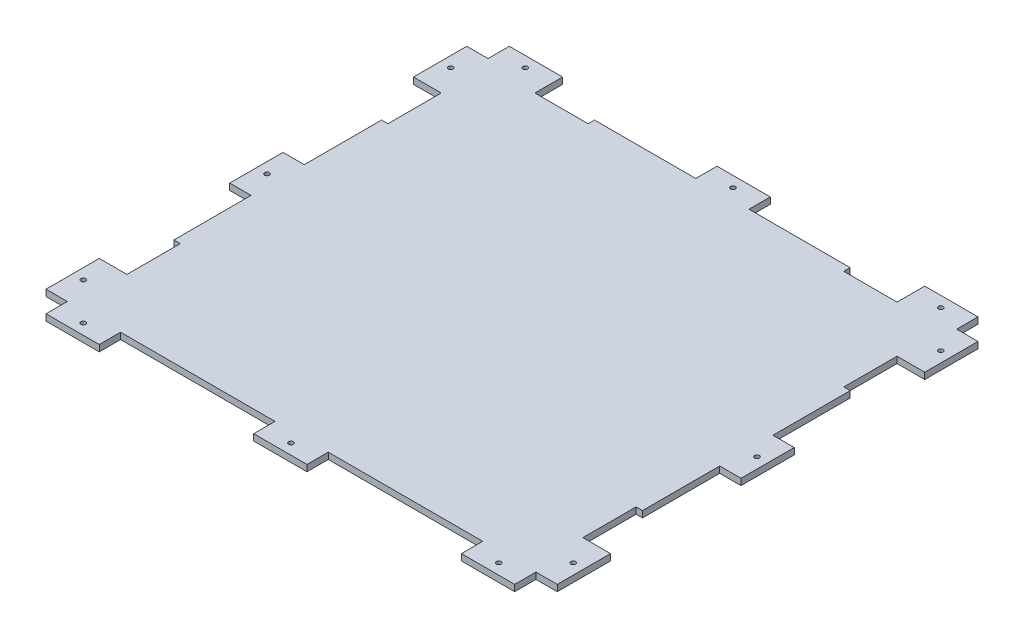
from build123d import *

# Parameters (mm, degrees)
AUFSATZ_LINEAR_AUSTRAGEN1_DEPTH = 6
SKIZZE2_R                       = 2.2
SCHNITT_LINEAR_AUSTRAGEN1_DEPTH = 324.94791248


with BuildPart() as part:
    # Skizze1 → Aufsatz-Linear austragen1 (new body)
    with BuildSketch(Plane(origin=(0, 0, 0), x_dir=(1, 0, 0), z_dir=(0, 1, 0))):
        Polygon((-220, 217.5), (-170, 217.5), (-170, 197.5), (-170, 191.5), (-120, 191.5), (-120, 197.5), (-25, 197.5), (-25, 217.5), (25, 217.5), (25, 197.5), (120, 197.5), (120, 191.5), (170, 191.5), (170, 197.5), (170, 217.5), (220, 217.5), (220, 197.5), (240, 197.5), (240, 147.5), (220, 147.5), (214, 147.5), (214, 97.5), (220, 97.5), (220, 25), (240, 25), (240, -25), (220, -25), (220, -97.5), (214, -97.5), (214, -147.5), (220, -147.5), (240, -147.5), (240, -197.5), (220, -197.5), (220, -217.5), (170, -217.5), (170, -197.5), (120, -197.5), (25, -197.5), (25, -217.5), (-25, -217.5), (-25, -197.5), (-120, -197.5), (-170, -197.5), (-170, -217.5), (-220, -217.5), (-220, -197.5), (-240, -197.5), (-240, -147.5), (-220, -147.5), (-214, -147.5), (-214, -97.5), (-220, -97.5), (-220, -25), (-240, -25), (-240, 25), (-220, 25), (-220, 97.5), (-214, 97.5), (-214, 147.5), (-220, 147.5), (-240, 147.5), (-240, 197.5), (-220, 197.5), align=None)
    extrude(amount=AUFSATZ_LINEAR_AUSTRAGEN1_DEPTH)

    # Skizze2 → Schnitt-Linear austragen1 (cut, through all)
    with BuildSketch(Plane(origin=(0, 6, 0), x_dir=(1, 0, 0), z_dir=(0, 1, 0))):
        with Locations(Location((-195, 207.5, 0), (0, 0, 270))):
            Circle(SKIZZE2_R)
        with Locations(Location((-230, 172.5, 0), (0, 0, 270))):
            Circle(SKIZZE2_R)
        with Locations(Location((230, 172.5, 0), (0, 0, 90))):
            Circle(SKIZZE2_R)
        with Locations(Location((195, 207.5, 0), (0, 0, 90))):
            Circle(SKIZZE2_R)
        with Locations(Location((0, 207.5, 0), (0, 0, 270))):
            Circle(SKIZZE2_R)
        with Locations(Location((0, -207.5, 0), (0, 0, 90))):
            Circle(SKIZZE2_R)
        with Locations(Location((-230, -172.5, 0), (0, 0, 90))):
            Circle(SKIZZE2_R)
        with Locations(Location((-195, -207.5, 0), (0, 0, 90))):
            Circle(SKIZZE2_R)
        with Locations(Location((195, -207.5, 0), (0, 0, 270))):
            Circle(SKIZZE2_R)
        with Locations(Location((230, -172.5, 0), (0, 0, 270))):
            Circle(SKIZZE2_R)
        with Locations(Location((-230, 0, 0), (0, 0, 270))):
            Circle(SKIZZE2_R)
        with Locations(Location((230, 0, 0), (0, 0, 90))):
            Circle(SKIZZE2_R)
    extrude(amount=-SCHNITT_LINEAR_AUSTRAGEN1_DEPTH, mode=Mode.SUBTRACT)


solid = part.part
